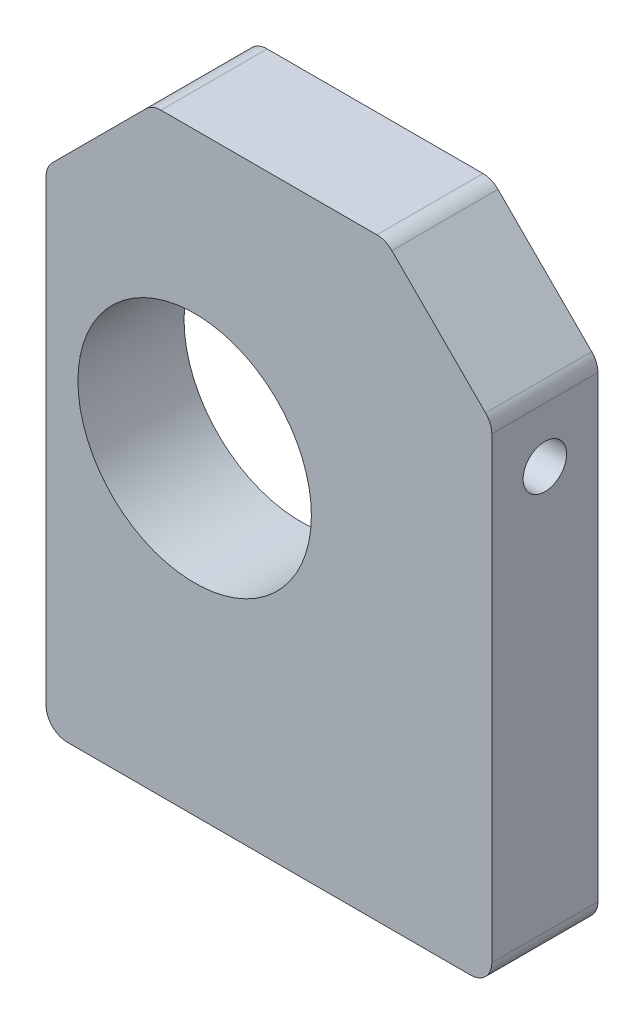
ISO-10303-21;
HEADER;
FILE_DESCRIPTION(('STEP AP214'),'2;1');
FILE_NAME('part.step','',(''),(''),'','','');
FILE_SCHEMA(('AUTOMOTIVE_DESIGN { 1 0 10303 214 1 1 1 1 }'));
ENDSEC;
DATA;
#1=APPLICATION_CONTEXT('core data for automotive mechanical design processes');
#2=APPLICATION_PROTOCOL_DEFINITION('international standard','automotive_design',2000,#1);
#3=PRODUCT_CONTEXT('',#1,'mechanical');
#4=PRODUCT('Part','Part','',(#3));
#5=PRODUCT_RELATED_PRODUCT_CATEGORY('part','',(#4));
#6=PRODUCT_DEFINITION_FORMATION('','',#4);
#7=PRODUCT_DEFINITION_CONTEXT('part definition',#1,'design');
#8=PRODUCT_DEFINITION('design','',#6,#7);
#9=PRODUCT_DEFINITION_SHAPE('','',#8);
#10=(LENGTH_UNIT() NAMED_UNIT(*) SI_UNIT(.MILLI.,.METRE.));
#11=(NAMED_UNIT(*) PLANE_ANGLE_UNIT() SI_UNIT($,.RADIAN.));
#12=(NAMED_UNIT(*) SI_UNIT($,.STERADIAN.) SOLID_ANGLE_UNIT());
#13=UNCERTAINTY_MEASURE_WITH_UNIT(LENGTH_MEASURE(1.E-05),#10,'distance_accuracy_value','');
#14=(GEOMETRIC_REPRESENTATION_CONTEXT(3) GLOBAL_UNCERTAINTY_ASSIGNED_CONTEXT((#13)) GLOBAL_UNIT_ASSIGNED_CONTEXT((#10,
#11,#12)) REPRESENTATION_CONTEXT('',''));
#15=CARTESIAN_POINT('',(0.,0.,0.));
#16=DIRECTION('',(0.,0.,1.));
#17=DIRECTION('',(1.,0.,0.));
#18=AXIS2_PLACEMENT_3D('',#15,#16,#17);
#19=CARTESIAN_POINT('',(0.,0.,5.));
#20=DIRECTION('',(0.,0.,-1.));
#21=DIRECTION('',(-1.,0.,0.));
#22=AXIS2_PLACEMENT_3D('',#19,#20,#21);
#23=PLANE('',#22);
#24=DIRECTION('',(1.,0.,0.));
#25=VECTOR('',#24,1.);
#26=CARTESIAN_POINT('',(0.,0.,5.));
#27=LINE('',#26,#25);
#28=CARTESIAN_POINT('',(1.,0.,5.));
#29=VERTEX_POINT('',#28);
#30=CARTESIAN_POINT('',(20.,0.,5.));
#31=VERTEX_POINT('',#30);
#32=EDGE_CURVE('E180',#29,#31,#27,.T.);
#33=ORIENTED_EDGE('',*,*,#32,.T.);
#34=CARTESIAN_POINT('',(20.,1.,5.));
#35=DIRECTION('',(0.,0.,-1.));
#36=DIRECTION('',(-1.,0.,0.));
#37=AXIS2_PLACEMENT_3D('',#34,#35,#36);
#38=CIRCLE('',#37,1.);
#39=CARTESIAN_POINT('',(21.,1.,5.));
#40=VERTEX_POINT('',#39);
#41=EDGE_CURVE('E240',#31,#40,#38,.F.);
#42=ORIENTED_EDGE('',*,*,#41,.T.);
#43=DIRECTION('',(0.,1.,0.));
#44=VECTOR('',#43,1.);
#45=CARTESIAN_POINT('',(21.,0.,5.));
#46=LINE('',#45,#44);
#47=CARTESIAN_POINT('',(21.,22.5857864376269,5.));
#48=VERTEX_POINT('',#47);
#49=EDGE_CURVE('E182',#40,#48,#46,.T.);
#50=ORIENTED_EDGE('',*,*,#49,.T.);
#51=CARTESIAN_POINT('',(20.,22.5857864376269,5.));
#52=DIRECTION('',(0.,0.,-1.));
#53=DIRECTION('',(-1.,0.,0.));
#54=AXIS2_PLACEMENT_3D('',#51,#52,#53);
#55=CIRCLE('',#54,1.);
#56=CARTESIAN_POINT('',(20.7071067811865,23.2928932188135,5.));
#57=VERTEX_POINT('',#56);
#58=EDGE_CURVE('E230',#48,#57,#55,.F.);
#59=ORIENTED_EDGE('',*,*,#58,.T.);
#60=DIRECTION('',(-0.707106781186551,0.707106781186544,0.));
#61=VECTOR('',#60,1.);
#62=CARTESIAN_POINT('',(21.,23.,5.));
#63=LINE('',#62,#61);
#64=CARTESIAN_POINT('',(16.2928932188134,27.7071067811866,5.));
#65=VERTEX_POINT('',#64);
#66=EDGE_CURVE('E184',#57,#65,#63,.T.);
#67=ORIENTED_EDGE('',*,*,#66,.T.);
#68=CARTESIAN_POINT('',(15.5857864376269,27.,5.));
#69=DIRECTION('',(0.,0.,-1.));
#70=DIRECTION('',(-1.,0.,0.));
#71=AXIS2_PLACEMENT_3D('',#68,#69,#70);
#72=CIRCLE('',#71,1.);
#73=CARTESIAN_POINT('',(15.5857864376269,28.,5.));
#74=VERTEX_POINT('',#73);
#75=EDGE_CURVE('E228',#65,#74,#72,.F.);
#76=ORIENTED_EDGE('',*,*,#75,.T.);
#77=DIRECTION('',(-1.,0.,0.));
#78=VECTOR('',#77,1.);
#79=CARTESIAN_POINT('',(4.99971988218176,28.,5.));
#80=LINE('',#79,#78);
#81=CARTESIAN_POINT('',(5.41393344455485,28.,5.));
#82=VERTEX_POINT('',#81);
#83=EDGE_CURVE('E189',#74,#82,#80,.T.);
#84=ORIENTED_EDGE('',*,*,#83,.T.);
#85=CARTESIAN_POINT('',(5.41393344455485,27.,5.));
#86=DIRECTION('',(0.,0.,-1.));
#87=DIRECTION('',(-1.,0.,0.));
#88=AXIS2_PLACEMENT_3D('',#85,#86,#87);
#89=CIRCLE('',#88,1.);
#90=CARTESIAN_POINT('',(4.70682666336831,27.7071067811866,5.));
#91=VERTEX_POINT('',#90);
#92=EDGE_CURVE('E63',#82,#91,#89,.F.);
#93=ORIENTED_EDGE('',*,*,#92,.T.);
#94=DIRECTION('',(-0.707106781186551,-0.707106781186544,0.));
#95=VECTOR('',#94,1.);
#96=CARTESIAN_POINT('',(4.99971988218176,28.,5.));
#97=LINE('',#96,#95);
#98=CARTESIAN_POINT('',(0.292893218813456,23.2931733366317,5.));
#99=VERTEX_POINT('',#98);
#100=EDGE_CURVE('E186',#91,#99,#97,.T.);
#101=ORIENTED_EDGE('',*,*,#100,.T.);
#102=CARTESIAN_POINT('',(1.,22.5860665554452,5.));
#103=DIRECTION('',(0.,0.,-1.));
#104=DIRECTION('',(-1.,0.,0.));
#105=AXIS2_PLACEMENT_3D('',#102,#103,#104);
#106=CIRCLE('',#105,1.);
#107=CARTESIAN_POINT('',(0.,22.5860665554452,5.));
#108=VERTEX_POINT('',#107);
#109=EDGE_CURVE('E231',#99,#108,#106,.F.);
#110=ORIENTED_EDGE('',*,*,#109,.T.);
#111=DIRECTION('',(0.,-1.,0.));
#112=VECTOR('',#111,1.);
#113=CARTESIAN_POINT('',(0.,0.,5.));
#114=LINE('',#113,#112);
#115=CARTESIAN_POINT('',(0.,1.,5.));
#116=VERTEX_POINT('',#115);
#117=EDGE_CURVE('E171',#108,#116,#114,.T.);
#118=ORIENTED_EDGE('',*,*,#117,.T.);
#119=CARTESIAN_POINT('',(1.,1.,5.));
#120=DIRECTION('',(0.,0.,-1.));
#121=DIRECTION('',(-1.,0.,0.));
#122=AXIS2_PLACEMENT_3D('',#119,#120,#121);
#123=CIRCLE('',#122,1.);
#124=EDGE_CURVE('E232',#116,#29,#123,.F.);
#125=ORIENTED_EDGE('',*,*,#124,.T.);
#126=EDGE_LOOP('',(#33,#42,#50,#59,#67,#76,#84,#93,#101,#110,#118,#125));
#127=FACE_BOUND('',#126,.T.);
#128=CARTESIAN_POINT('',(7.,15.,5.));
#129=DIRECTION('',(0.,0.,1.));
#130=DIRECTION('',(1.,0.,0.));
#131=AXIS2_PLACEMENT_3D('',#128,#129,#130);
#132=CIRCLE('',#131,5.5);
#133=CARTESIAN_POINT('',(12.5,15.,5.));
#134=VERTEX_POINT('',#133);
#135=EDGE_CURVE('E169',#134,#134,#132,.T.);
#136=ORIENTED_EDGE('',*,*,#135,.F.);
#137=EDGE_LOOP('',(#136));
#138=FACE_BOUND('',#137,.T.);
#139=ADVANCED_FACE('F43',(#127,#138),#23,.F.);
#140=CARTESIAN_POINT('',(0.,0.,0.));
#141=DIRECTION('',(0.,0.,-1.));
#142=DIRECTION('',(-1.,0.,0.));
#143=AXIS2_PLACEMENT_3D('',#140,#141,#142);
#144=PLANE('',#143);
#145=DIRECTION('',(0.,1.,0.));
#146=VECTOR('',#145,1.);
#147=CARTESIAN_POINT('',(21.,0.,0.));
#148=LINE('',#147,#146);
#149=CARTESIAN_POINT('',(21.,1.,0.));
#150=VERTEX_POINT('',#149);
#151=CARTESIAN_POINT('',(21.,22.5857864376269,0.));
#152=VERTEX_POINT('',#151);
#153=EDGE_CURVE('E197',#150,#152,#148,.T.);
#154=ORIENTED_EDGE('',*,*,#153,.F.);
#155=CARTESIAN_POINT('',(20.,1.,0.));
#156=DIRECTION('',(0.,0.,-1.));
#157=DIRECTION('',(-1.,0.,0.));
#158=AXIS2_PLACEMENT_3D('',#155,#156,#157);
#159=CIRCLE('',#158,1.);
#160=CARTESIAN_POINT('',(20.,0.,0.));
#161=VERTEX_POINT('',#160);
#162=EDGE_CURVE('E222',#150,#161,#159,.T.);
#163=ORIENTED_EDGE('',*,*,#162,.T.);
#164=DIRECTION('',(1.,0.,0.));
#165=VECTOR('',#164,1.);
#166=CARTESIAN_POINT('',(0.,0.,0.));
#167=LINE('',#166,#165);
#168=CARTESIAN_POINT('',(1.,0.,0.));
#169=VERTEX_POINT('',#168);
#170=EDGE_CURVE('E194',#169,#161,#167,.T.);
#171=ORIENTED_EDGE('',*,*,#170,.F.);
#172=CARTESIAN_POINT('',(1.,1.,0.));
#173=DIRECTION('',(0.,0.,-1.));
#174=DIRECTION('',(-1.,0.,0.));
#175=AXIS2_PLACEMENT_3D('',#172,#173,#174);
#176=CIRCLE('',#175,1.);
#177=CARTESIAN_POINT('',(0.,1.,0.));
#178=VERTEX_POINT('',#177);
#179=EDGE_CURVE('E218',#169,#178,#176,.T.);
#180=ORIENTED_EDGE('',*,*,#179,.T.);
#181=DIRECTION('',(0.,-1.,0.));
#182=VECTOR('',#181,1.);
#183=CARTESIAN_POINT('',(0.,0.,0.));
#184=LINE('',#183,#182);
#185=CARTESIAN_POINT('',(0.,22.5860665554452,0.));
#186=VERTEX_POINT('',#185);
#187=EDGE_CURVE('E172',#186,#178,#184,.T.);
#188=ORIENTED_EDGE('',*,*,#187,.F.);
#189=CARTESIAN_POINT('',(1.,22.5860665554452,0.));
#190=DIRECTION('',(0.,0.,-1.));
#191=DIRECTION('',(-1.,0.,0.));
#192=AXIS2_PLACEMENT_3D('',#189,#190,#191);
#193=CIRCLE('',#192,1.);
#194=CARTESIAN_POINT('',(0.292893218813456,23.2931733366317,0.));
#195=VERTEX_POINT('',#194);
#196=EDGE_CURVE('E220',#186,#195,#193,.T.);
#197=ORIENTED_EDGE('',*,*,#196,.T.);
#198=DIRECTION('',(-0.707106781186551,-0.707106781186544,0.));
#199=VECTOR('',#198,1.);
#200=CARTESIAN_POINT('',(4.99971988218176,28.,0.));
#201=LINE('',#200,#199);
#202=CARTESIAN_POINT('',(4.70682666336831,27.7071067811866,0.));
#203=VERTEX_POINT('',#202);
#204=EDGE_CURVE('E176',#203,#195,#201,.T.);
#205=ORIENTED_EDGE('',*,*,#204,.F.);
#206=CARTESIAN_POINT('',(5.41393344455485,27.,0.));
#207=DIRECTION('',(0.,0.,-1.));
#208=DIRECTION('',(-1.,0.,0.));
#209=AXIS2_PLACEMENT_3D('',#206,#207,#208);
#210=CIRCLE('',#209,1.);
#211=CARTESIAN_POINT('',(5.41393344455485,28.,0.));
#212=VERTEX_POINT('',#211);
#213=EDGE_CURVE('E214',#203,#212,#210,.T.);
#214=ORIENTED_EDGE('',*,*,#213,.T.);
#215=DIRECTION('',(-1.,0.,0.));
#216=VECTOR('',#215,1.);
#217=CARTESIAN_POINT('',(4.99971988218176,28.,0.));
#218=LINE('',#217,#216);
#219=CARTESIAN_POINT('',(15.5857864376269,28.,0.));
#220=VERTEX_POINT('',#219);
#221=EDGE_CURVE('E201',#220,#212,#218,.T.);
#222=ORIENTED_EDGE('',*,*,#221,.F.);
#223=CARTESIAN_POINT('',(15.5857864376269,27.,0.));
#224=DIRECTION('',(0.,0.,-1.));
#225=DIRECTION('',(-1.,0.,0.));
#226=AXIS2_PLACEMENT_3D('',#223,#224,#225);
#227=CIRCLE('',#226,1.);
#228=CARTESIAN_POINT('',(16.2928932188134,27.7071067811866,0.));
#229=VERTEX_POINT('',#228);
#230=EDGE_CURVE('E213',#220,#229,#227,.T.);
#231=ORIENTED_EDGE('',*,*,#230,.T.);
#232=DIRECTION('',(-0.707106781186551,0.707106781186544,0.));
#233=VECTOR('',#232,1.);
#234=CARTESIAN_POINT('',(21.,23.,0.));
#235=LINE('',#234,#233);
#236=CARTESIAN_POINT('',(20.7071067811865,23.2928932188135,0.));
#237=VERTEX_POINT('',#236);
#238=EDGE_CURVE('E199',#237,#229,#235,.T.);
#239=ORIENTED_EDGE('',*,*,#238,.F.);
#240=CARTESIAN_POINT('',(20.,22.5857864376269,0.));
#241=DIRECTION('',(0.,0.,-1.));
#242=DIRECTION('',(-1.,0.,0.));
#243=AXIS2_PLACEMENT_3D('',#240,#241,#242);
#244=CIRCLE('',#243,1.);
#245=EDGE_CURVE('E211',#237,#152,#244,.T.);
#246=ORIENTED_EDGE('',*,*,#245,.T.);
#247=EDGE_LOOP('',(#154,#163,#171,#180,#188,#197,#205,#214,#222,#231,#239,#246));
#248=FACE_BOUND('',#247,.T.);
#249=CARTESIAN_POINT('',(7.,15.,0.));
#250=DIRECTION('',(0.,0.,1.));
#251=DIRECTION('',(1.,0.,0.));
#252=AXIS2_PLACEMENT_3D('',#249,#250,#251);
#253=CIRCLE('',#252,5.5);
#254=CARTESIAN_POINT('',(12.5,15.,0.));
#255=VERTEX_POINT('',#254);
#256=EDGE_CURVE('E170',#255,#255,#253,.T.);
#257=ORIENTED_EDGE('',*,*,#256,.T.);
#258=EDGE_LOOP('',(#257));
#259=FACE_BOUND('',#258,.T.);
#260=ADVANCED_FACE('F263',(#248,#259),#144,.T.);
#261=CARTESIAN_POINT('',(0.,0.,5.));
#262=DIRECTION('',(1.,0.,0.));
#263=DIRECTION('',(0.,0.,-1.));
#264=AXIS2_PLACEMENT_3D('',#261,#262,#263);
#265=PLANE('',#264);
#266=ORIENTED_EDGE('',*,*,#187,.T.);
#267=DIRECTION('',(0.,0.,-1.));
#268=VECTOR('',#267,1.);
#269=CARTESIAN_POINT('',(0.,1.,5.));
#270=LINE('',#269,#268);
#271=EDGE_CURVE('E244',#178,#116,#270,.F.);
#272=ORIENTED_EDGE('',*,*,#271,.T.);
#273=ORIENTED_EDGE('',*,*,#117,.F.);
#274=DIRECTION('',(0.,0.,-1.));
#275=VECTOR('',#274,1.);
#276=CARTESIAN_POINT('',(0.,22.5860665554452,5.));
#277=LINE('',#276,#275);
#278=EDGE_CURVE('E239',#108,#186,#277,.T.);
#279=ORIENTED_EDGE('',*,*,#278,.T.);
#280=EDGE_LOOP('',(#266,#272,#273,#279));
#281=FACE_BOUND('',#280,.T.);
#282=ADVANCED_FACE('F290',(#281),#265,.F.);
#283=CARTESIAN_POINT('',(0.,0.,5.));
#284=DIRECTION('',(0.,1.,0.));
#285=DIRECTION('',(0.,0.,1.));
#286=AXIS2_PLACEMENT_3D('',#283,#284,#285);
#287=PLANE('',#286);
#288=CARTESIAN_POINT('',(13.,0.,2.5));
#289=DIRECTION('',(0.,-1.,0.));
#290=DIRECTION('',(0.,0.,-1.));
#291=AXIS2_PLACEMENT_3D('',#288,#289,#290);
#292=CIRCLE('',#291,1.02499999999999);
#293=CARTESIAN_POINT('',(13.,0.,1.47500000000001));
#294=VERTEX_POINT('',#293);
#295=EDGE_CURVE('E151',#294,#294,#292,.T.);
#296=ORIENTED_EDGE('',*,*,#295,.F.);
#297=EDGE_LOOP('',(#296));
#298=FACE_BOUND('',#297,.T.);
#299=CARTESIAN_POINT('',(3.5,0.,2.5));
#300=DIRECTION('',(0.,-1.,0.));
#301=DIRECTION('',(0.,0.,-1.));
#302=AXIS2_PLACEMENT_3D('',#299,#300,#301);
#303=CIRCLE('',#302,1.02499999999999);
#304=CARTESIAN_POINT('',(3.5,0.,1.47500000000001));
#305=VERTEX_POINT('',#304);
#306=EDGE_CURVE('E147',#305,#305,#303,.T.);
#307=ORIENTED_EDGE('',*,*,#306,.F.);
#308=EDGE_LOOP('',(#307));
#309=FACE_BOUND('',#308,.T.);
#310=ORIENTED_EDGE('',*,*,#170,.T.);
#311=DIRECTION('',(0.,0.,-1.));
#312=VECTOR('',#311,1.);
#313=CARTESIAN_POINT('',(20.,0.,5.));
#314=LINE('',#313,#312);
#315=EDGE_CURVE('E227',#161,#31,#314,.F.);
#316=ORIENTED_EDGE('',*,*,#315,.T.);
#317=ORIENTED_EDGE('',*,*,#32,.F.);
#318=DIRECTION('',(0.,0.,-1.));
#319=VECTOR('',#318,1.);
#320=CARTESIAN_POINT('',(1.,0.,5.));
#321=LINE('',#320,#319);
#322=EDGE_CURVE('E224',#29,#169,#321,.T.);
#323=ORIENTED_EDGE('',*,*,#322,.T.);
#324=EDGE_LOOP('',(#310,#316,#317,#323));
#325=FACE_BOUND('',#324,.T.);
#326=ADVANCED_FACE('F297',(#298,#309,#325),#287,.F.);
#327=CARTESIAN_POINT('',(21.,0.,5.));
#328=DIRECTION('',(-1.,0.,0.));
#329=DIRECTION('',(0.,0.,1.));
#330=AXIS2_PLACEMENT_3D('',#327,#328,#329);
#331=PLANE('',#330);
#332=CARTESIAN_POINT('',(21.,20.,2.5));
#333=DIRECTION('',(1.,0.,0.));
#334=DIRECTION('',(0.,0.,-1.));
#335=AXIS2_PLACEMENT_3D('',#332,#333,#334);
#336=CIRCLE('',#335,1.02499999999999);
#337=CARTESIAN_POINT('',(21.,20.,1.47500000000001));
#338=VERTEX_POINT('',#337);
#339=EDGE_CURVE('E161',#338,#338,#336,.T.);
#340=ORIENTED_EDGE('',*,*,#339,.F.);
#341=EDGE_LOOP('',(#340));
#342=FACE_BOUND('',#341,.T.);
#343=ORIENTED_EDGE('',*,*,#49,.F.);
#344=DIRECTION('',(0.,0.,-1.));
#345=VECTOR('',#344,1.);
#346=CARTESIAN_POINT('',(21.,1.,5.));
#347=LINE('',#346,#345);
#348=EDGE_CURVE('E208',#40,#150,#347,.T.);
#349=ORIENTED_EDGE('',*,*,#348,.T.);
#350=ORIENTED_EDGE('',*,*,#153,.T.);
#351=DIRECTION('',(0.,0.,-1.));
#352=VECTOR('',#351,1.);
#353=CARTESIAN_POINT('',(21.,22.5857864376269,5.));
#354=LINE('',#353,#352);
#355=EDGE_CURVE('E193',#152,#48,#354,.F.);
#356=ORIENTED_EDGE('',*,*,#355,.T.);
#357=EDGE_LOOP('',(#343,#349,#350,#356));
#358=FACE_BOUND('',#357,.T.);
#359=ADVANCED_FACE('F304',(#342,#358),#331,.F.);
#360=CARTESIAN_POINT('',(21.,23.,5.));
#361=DIRECTION('',(-0.707106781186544,-0.707106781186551,0.));
#362=DIRECTION('',(0.707106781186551,-0.707106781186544,0.));
#363=AXIS2_PLACEMENT_3D('',#360,#361,#362);
#364=PLANE('',#363);
#365=ORIENTED_EDGE('',*,*,#238,.T.);
#366=DIRECTION('',(0.,0.,-1.));
#367=VECTOR('',#366,1.);
#368=CARTESIAN_POINT('',(16.2928932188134,27.7071067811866,5.));
#369=LINE('',#368,#367);
#370=EDGE_CURVE('E11',#229,#65,#369,.F.);
#371=ORIENTED_EDGE('',*,*,#370,.T.);
#372=ORIENTED_EDGE('',*,*,#66,.F.);
#373=DIRECTION('',(0.,0.,-1.));
#374=VECTOR('',#373,1.);
#375=CARTESIAN_POINT('',(20.7071067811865,23.2928932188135,5.));
#376=LINE('',#375,#374);
#377=EDGE_CURVE('E51',#57,#237,#376,.T.);
#378=ORIENTED_EDGE('',*,*,#377,.T.);
#379=EDGE_LOOP('',(#365,#371,#372,#378));
#380=FACE_BOUND('',#379,.T.);
#381=ADVANCED_FACE('F260',(#380),#364,.F.);
#382=CARTESIAN_POINT('',(4.99971988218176,28.,5.));
#383=DIRECTION('',(0.,-1.,0.));
#384=DIRECTION('',(0.,0.,-1.));
#385=AXIS2_PLACEMENT_3D('',#382,#383,#384);
#386=PLANE('',#385);
#387=ORIENTED_EDGE('',*,*,#221,.T.);
#388=DIRECTION('',(0.,0.,-1.));
#389=VECTOR('',#388,1.);
#390=CARTESIAN_POINT('',(5.41393344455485,28.,5.));
#391=LINE('',#390,#389);
#392=EDGE_CURVE('E253',#212,#82,#391,.F.);
#393=ORIENTED_EDGE('',*,*,#392,.T.);
#394=ORIENTED_EDGE('',*,*,#83,.F.);
#395=DIRECTION('',(0.,0.,-1.));
#396=VECTOR('',#395,1.);
#397=CARTESIAN_POINT('',(15.5857864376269,28.,5.));
#398=LINE('',#397,#396);
#399=EDGE_CURVE('E246',#74,#220,#398,.T.);
#400=ORIENTED_EDGE('',*,*,#399,.T.);
#401=EDGE_LOOP('',(#387,#393,#394,#400));
#402=FACE_BOUND('',#401,.T.);
#403=ADVANCED_FACE('F275',(#402),#386,.F.);
#404=CARTESIAN_POINT('',(4.99971988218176,28.,5.));
#405=DIRECTION('',(0.707106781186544,-0.707106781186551,0.));
#406=DIRECTION('',(0.707106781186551,0.707106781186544,0.));
#407=AXIS2_PLACEMENT_3D('',#404,#405,#406);
#408=PLANE('',#407);
#409=ORIENTED_EDGE('',*,*,#204,.T.);
#410=DIRECTION('',(0.,0.,-1.));
#411=VECTOR('',#410,1.);
#412=CARTESIAN_POINT('',(0.292893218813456,23.2931733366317,5.));
#413=LINE('',#412,#411);
#414=EDGE_CURVE('E59',#195,#99,#413,.F.);
#415=ORIENTED_EDGE('',*,*,#414,.T.);
#416=ORIENTED_EDGE('',*,*,#100,.F.);
#417=DIRECTION('',(0.,0.,-1.));
#418=VECTOR('',#417,1.);
#419=CARTESIAN_POINT('',(4.70682666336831,27.7071067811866,5.));
#420=LINE('',#419,#418);
#421=EDGE_CURVE('E241',#91,#203,#420,.T.);
#422=ORIENTED_EDGE('',*,*,#421,.T.);
#423=EDGE_LOOP('',(#409,#415,#416,#422));
#424=FACE_BOUND('',#423,.T.);
#425=ADVANCED_FACE('F276',(#424),#408,.F.);
#426=CARTESIAN_POINT('',(7.,15.,5.));
#427=DIRECTION('',(0.,0.,-1.));
#428=DIRECTION('',(-1.,0.,0.));
#429=AXIS2_PLACEMENT_3D('',#426,#427,#428);
#430=CYLINDRICAL_SURFACE('',#429,5.5);
#431=ORIENTED_EDGE('',*,*,#135,.T.);
#432=EDGE_LOOP('',(#431));
#433=FACE_BOUND('',#432,.T.);
#434=ORIENTED_EDGE('',*,*,#256,.F.);
#435=EDGE_LOOP('',(#434));
#436=FACE_BOUND('',#435,.T.);
#437=ADVANCED_FACE('F318',(#433,#436),#430,.F.);
#438=CARTESIAN_POINT('',(19.,20.,2.5));
#439=DIRECTION('',(1.,0.,0.));
#440=DIRECTION('',(0.,0.,-1.));
#441=AXIS2_PLACEMENT_3D('',#438,#439,#440);
#442=CONICAL_SURFACE('',#441,1.025,1.02974425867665);
#443=CARTESIAN_POINT('',(18.3841178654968,20.,2.5));
#444=VERTEX_POINT('',#443);
#445=VERTEX_LOOP('',#444);
#446=FACE_BOUND('',#445,.T.);
#447=CARTESIAN_POINT('',(19.,20.,2.5));
#448=DIRECTION('',(1.,0.,0.));
#449=DIRECTION('',(0.,0.,-1.));
#450=AXIS2_PLACEMENT_3D('',#447,#448,#449);
#451=CIRCLE('',#450,1.025);
#452=CARTESIAN_POINT('',(19.,20.,1.475));
#453=VERTEX_POINT('',#452);
#454=EDGE_CURVE('E163',#453,#453,#451,.T.);
#455=ORIENTED_EDGE('',*,*,#454,.T.);
#456=EDGE_LOOP('',(#455));
#457=FACE_BOUND('',#456,.T.);
#458=ADVANCED_FACE('F408',(#446,#457),#442,.F.);
#459=CARTESIAN_POINT('',(21.,20.,2.5));
#460=DIRECTION('',(1.,0.,0.));
#461=DIRECTION('',(0.,0.,-1.));
#462=AXIS2_PLACEMENT_3D('',#459,#460,#461);
#463=CYLINDRICAL_SURFACE('',#462,1.02499999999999);
#464=ORIENTED_EDGE('',*,*,#454,.F.);
#465=EDGE_LOOP('',(#464));
#466=FACE_BOUND('',#465,.T.);
#467=ORIENTED_EDGE('',*,*,#339,.T.);
#468=EDGE_LOOP('',(#467));
#469=FACE_BOUND('',#468,.T.);
#470=ADVANCED_FACE('F402',(#466,#469),#463,.F.);
#471=CARTESIAN_POINT('',(3.5,2.,2.5));
#472=DIRECTION('',(0.,-1.,0.));
#473=DIRECTION('',(0.,0.,-1.));
#474=AXIS2_PLACEMENT_3D('',#471,#472,#473);
#475=CONICAL_SURFACE('',#474,1.025,1.02974425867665);
#476=CARTESIAN_POINT('',(3.5,2.61588213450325,2.5));
#477=VERTEX_POINT('',#476);
#478=VERTEX_LOOP('',#477);
#479=FACE_BOUND('',#478,.T.);
#480=CARTESIAN_POINT('',(3.5,2.,2.5));
#481=DIRECTION('',(0.,-1.,0.));
#482=DIRECTION('',(0.,0.,-1.));
#483=AXIS2_PLACEMENT_3D('',#480,#481,#482);
#484=CIRCLE('',#483,1.025);
#485=CARTESIAN_POINT('',(3.5,2.,1.475));
#486=VERTEX_POINT('',#485);
#487=EDGE_CURVE('E152',#486,#486,#484,.T.);
#488=ORIENTED_EDGE('',*,*,#487,.T.);
#489=EDGE_LOOP('',(#488));
#490=FACE_BOUND('',#489,.T.);
#491=ADVANCED_FACE('F392',(#479,#490),#475,.F.);
#492=CARTESIAN_POINT('',(3.5,0.,2.5));
#493=DIRECTION('',(0.,-1.,0.));
#494=DIRECTION('',(0.,0.,-1.));
#495=AXIS2_PLACEMENT_3D('',#492,#493,#494);
#496=CYLINDRICAL_SURFACE('',#495,1.02499999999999);
#497=ORIENTED_EDGE('',*,*,#487,.F.);
#498=EDGE_LOOP('',(#497));
#499=FACE_BOUND('',#498,.T.);
#500=ORIENTED_EDGE('',*,*,#306,.T.);
#501=EDGE_LOOP('',(#500));
#502=FACE_BOUND('',#501,.T.);
#503=ADVANCED_FACE('F145',(#499,#502),#496,.F.);
#504=CARTESIAN_POINT('',(13.,2.,2.5));
#505=DIRECTION('',(0.,-1.,0.));
#506=DIRECTION('',(0.,0.,-1.));
#507=AXIS2_PLACEMENT_3D('',#504,#505,#506);
#508=CONICAL_SURFACE('',#507,1.025,1.02974425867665);
#509=CARTESIAN_POINT('',(13.,2.61588213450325,2.5));
#510=VERTEX_POINT('',#509);
#511=VERTEX_LOOP('',#510);
#512=FACE_BOUND('',#511,.T.);
#513=CARTESIAN_POINT('',(13.,2.,2.5));
#514=DIRECTION('',(0.,-1.,0.));
#515=DIRECTION('',(0.,0.,-1.));
#516=AXIS2_PLACEMENT_3D('',#513,#514,#515);
#517=CIRCLE('',#516,1.025);
#518=CARTESIAN_POINT('',(13.,2.,1.475));
#519=VERTEX_POINT('',#518);
#520=EDGE_CURVE('E146',#519,#519,#517,.T.);
#521=ORIENTED_EDGE('',*,*,#520,.T.);
#522=EDGE_LOOP('',(#521));
#523=FACE_BOUND('',#522,.T.);
#524=ADVANCED_FACE('F137',(#512,#523),#508,.F.);
#525=CARTESIAN_POINT('',(13.,0.,2.5));
#526=DIRECTION('',(0.,-1.,0.));
#527=DIRECTION('',(0.,0.,-1.));
#528=AXIS2_PLACEMENT_3D('',#525,#526,#527);
#529=CYLINDRICAL_SURFACE('',#528,1.02499999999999);
#530=ORIENTED_EDGE('',*,*,#520,.F.);
#531=EDGE_LOOP('',(#530));
#532=FACE_BOUND('',#531,.T.);
#533=ORIENTED_EDGE('',*,*,#295,.T.);
#534=EDGE_LOOP('',(#533));
#535=FACE_BOUND('',#534,.T.);
#536=ADVANCED_FACE('F141',(#532,#535),#529,.F.);
#537=CARTESIAN_POINT('',(20.,1.,5.));
#538=DIRECTION('',(0.,0.,-1.));
#539=DIRECTION('',(-1.,0.,0.));
#540=AXIS2_PLACEMENT_3D('',#537,#538,#539);
#541=CYLINDRICAL_SURFACE('',#540,1.);
#542=ORIENTED_EDGE('',*,*,#41,.F.);
#543=ORIENTED_EDGE('',*,*,#315,.F.);
#544=ORIENTED_EDGE('',*,*,#162,.F.);
#545=ORIENTED_EDGE('',*,*,#348,.F.);
#546=EDGE_LOOP('',(#542,#543,#544,#545));
#547=FACE_BOUND('',#546,.T.);
#548=ADVANCED_FACE('F303',(#547),#541,.T.);
#549=CARTESIAN_POINT('',(1.,1.,5.));
#550=DIRECTION('',(0.,0.,-1.));
#551=DIRECTION('',(-1.,0.,0.));
#552=AXIS2_PLACEMENT_3D('',#549,#550,#551);
#553=CYLINDRICAL_SURFACE('',#552,1.);
#554=ORIENTED_EDGE('',*,*,#124,.F.);
#555=ORIENTED_EDGE('',*,*,#271,.F.);
#556=ORIENTED_EDGE('',*,*,#179,.F.);
#557=ORIENTED_EDGE('',*,*,#322,.F.);
#558=EDGE_LOOP('',(#554,#555,#556,#557));
#559=FACE_BOUND('',#558,.T.);
#560=ADVANCED_FACE('F291',(#559),#553,.T.);
#561=CARTESIAN_POINT('',(1.,22.5860665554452,5.));
#562=DIRECTION('',(0.,0.,-1.));
#563=DIRECTION('',(-1.,0.,0.));
#564=AXIS2_PLACEMENT_3D('',#561,#562,#563);
#565=CYLINDRICAL_SURFACE('',#564,1.);
#566=ORIENTED_EDGE('',*,*,#109,.F.);
#567=ORIENTED_EDGE('',*,*,#414,.F.);
#568=ORIENTED_EDGE('',*,*,#196,.F.);
#569=ORIENTED_EDGE('',*,*,#278,.F.);
#570=EDGE_LOOP('',(#566,#567,#568,#569));
#571=FACE_BOUND('',#570,.T.);
#572=ADVANCED_FACE('F281',(#571),#565,.T.);
#573=CARTESIAN_POINT('',(5.41393344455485,27.,5.));
#574=DIRECTION('',(0.,0.,-1.));
#575=DIRECTION('',(-1.,0.,0.));
#576=AXIS2_PLACEMENT_3D('',#573,#574,#575);
#577=CYLINDRICAL_SURFACE('',#576,1.);
#578=ORIENTED_EDGE('',*,*,#92,.F.);
#579=ORIENTED_EDGE('',*,*,#392,.F.);
#580=ORIENTED_EDGE('',*,*,#213,.F.);
#581=ORIENTED_EDGE('',*,*,#421,.F.);
#582=EDGE_LOOP('',(#578,#579,#580,#581));
#583=FACE_BOUND('',#582,.T.);
#584=ADVANCED_FACE('F280',(#583),#577,.T.);
#585=CARTESIAN_POINT('',(15.5857864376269,27.,5.));
#586=DIRECTION('',(0.,0.,-1.));
#587=DIRECTION('',(-1.,0.,0.));
#588=AXIS2_PLACEMENT_3D('',#585,#586,#587);
#589=CYLINDRICAL_SURFACE('',#588,1.);
#590=ORIENTED_EDGE('',*,*,#75,.F.);
#591=ORIENTED_EDGE('',*,*,#370,.F.);
#592=ORIENTED_EDGE('',*,*,#230,.F.);
#593=ORIENTED_EDGE('',*,*,#399,.F.);
#594=EDGE_LOOP('',(#590,#591,#592,#593));
#595=FACE_BOUND('',#594,.T.);
#596=ADVANCED_FACE('F267',(#595),#589,.T.);
#597=CARTESIAN_POINT('',(20.,22.5857864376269,5.));
#598=DIRECTION('',(0.,0.,-1.));
#599=DIRECTION('',(-1.,0.,0.));
#600=AXIS2_PLACEMENT_3D('',#597,#598,#599);
#601=CYLINDRICAL_SURFACE('',#600,1.);
#602=ORIENTED_EDGE('',*,*,#58,.F.);
#603=ORIENTED_EDGE('',*,*,#355,.F.);
#604=ORIENTED_EDGE('',*,*,#245,.F.);
#605=ORIENTED_EDGE('',*,*,#377,.F.);
#606=EDGE_LOOP('',(#602,#603,#604,#605));
#607=FACE_BOUND('',#606,.T.);
#608=ADVANCED_FACE('F44',(#607),#601,.T.);
#609=CLOSED_SHELL('',(#139,#260,#282,#326,#359,#381,#403,#425,#437,#458,#470,#491,#503,#524,
#536,#548,#560,#572,#584,#596,#608));
#610=MANIFOLD_SOLID_BREP('B2',#609);
#611=ADVANCED_BREP_SHAPE_REPRESENTATION('',(#18,#610),#14);
#612=SHAPE_DEFINITION_REPRESENTATION(#9,#611);
ENDSEC;
END-ISO-10303-21;
